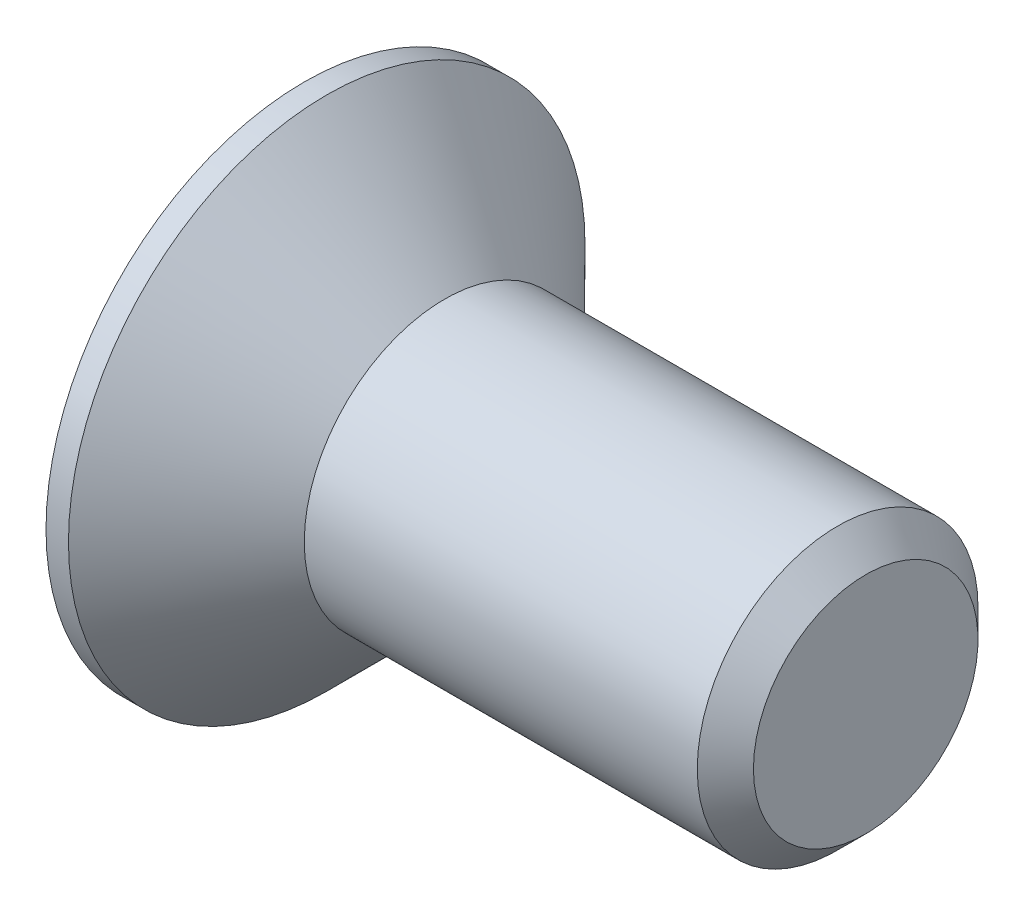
ISO-10303-21;
HEADER;
FILE_DESCRIPTION(('STEP AP214'),'2;1');
FILE_NAME('part.step','',(''),(''),'','','');
FILE_SCHEMA(('AUTOMOTIVE_DESIGN { 1 0 10303 214 1 1 1 1 }'));
ENDSEC;
DATA;
#1=APPLICATION_CONTEXT('core data for automotive mechanical design processes');
#2=APPLICATION_PROTOCOL_DEFINITION('international standard','automotive_design',2000,#1);
#3=PRODUCT_CONTEXT('',#1,'mechanical');
#4=PRODUCT('Part','Part','',(#3));
#5=PRODUCT_RELATED_PRODUCT_CATEGORY('part','',(#4));
#6=PRODUCT_DEFINITION_FORMATION('','',#4);
#7=PRODUCT_DEFINITION_CONTEXT('part definition',#1,'design');
#8=PRODUCT_DEFINITION('design','',#6,#7);
#9=PRODUCT_DEFINITION_SHAPE('','',#8);
#10=(LENGTH_UNIT() NAMED_UNIT(*) SI_UNIT(.MILLI.,.METRE.));
#11=(NAMED_UNIT(*) PLANE_ANGLE_UNIT() SI_UNIT($,.RADIAN.));
#12=(NAMED_UNIT(*) SI_UNIT($,.STERADIAN.) SOLID_ANGLE_UNIT());
#13=UNCERTAINTY_MEASURE_WITH_UNIT(LENGTH_MEASURE(1.E-05),#10,'distance_accuracy_value','');
#14=(GEOMETRIC_REPRESENTATION_CONTEXT(3) GLOBAL_UNCERTAINTY_ASSIGNED_CONTEXT((#13)) GLOBAL_UNIT_ASSIGNED_CONTEXT((#10,
#11,#12)) REPRESENTATION_CONTEXT('',''));
#15=CARTESIAN_POINT('',(0.,0.,0.));
#16=DIRECTION('',(0.,0.,1.));
#17=DIRECTION('',(1.,0.,0.));
#18=AXIS2_PLACEMENT_3D('',#15,#16,#17);
#19=CARTESIAN_POINT('',(0.,0.,0.));
#20=DIRECTION('',(-1.,0.,0.));
#21=DIRECTION('',(0.,0.,1.));
#22=AXIS2_PLACEMENT_3D('',#19,#20,#21);
#23=CONICAL_SURFACE('',#22,2.5,0.78539816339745);
#24=CARTESIAN_POINT('',(-2.09999999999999,0.,0.));
#25=DIRECTION('',(-1.,0.,0.));
#26=DIRECTION('',(0.,0.,1.));
#27=AXIS2_PLACEMENT_3D('',#24,#25,#26);
#28=CIRCLE('',#27,4.6);
#29=CARTESIAN_POINT('',(-2.09999999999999,0.,4.6));
#30=VERTEX_POINT('',#29);
#31=EDGE_CURVE('E189',#30,#30,#28,.T.);
#32=ORIENTED_EDGE('',*,*,#31,.F.);
#33=EDGE_LOOP('',(#32));
#34=FACE_BOUND('',#33,.T.);
#35=CARTESIAN_POINT('',(0.,0.,0.));
#36=DIRECTION('',(-1.,0.,0.));
#37=DIRECTION('',(0.,0.,1.));
#38=AXIS2_PLACEMENT_3D('',#35,#36,#37);
#39=CIRCLE('',#38,2.5);
#40=CARTESIAN_POINT('',(0.,0.,2.5));
#41=VERTEX_POINT('',#40);
#42=EDGE_CURVE('E212',#41,#41,#39,.T.);
#43=ORIENTED_EDGE('',*,*,#42,.T.);
#44=EDGE_LOOP('',(#43));
#45=FACE_BOUND('',#44,.T.);
#46=ADVANCED_FACE('F33',(#34,#45),#23,.T.);
#47=CARTESIAN_POINT('',(-2.5,0.,0.));
#48=DIRECTION('',(-1.,0.,0.));
#49=DIRECTION('',(0.,0.,1.));
#50=AXIS2_PLACEMENT_3D('',#47,#48,#49);
#51=CYLINDRICAL_SURFACE('',#50,2.5);
#52=CARTESIAN_POINT('',(6.99999999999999,0.,0.));
#53=DIRECTION('',(-1.,0.,0.));
#54=DIRECTION('',(0.,0.,1.));
#55=AXIS2_PLACEMENT_3D('',#52,#53,#54);
#56=CIRCLE('',#55,2.5);
#57=CARTESIAN_POINT('',(6.99999999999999,0.,2.5));
#58=VERTEX_POINT('',#57);
#59=EDGE_CURVE('E41',#58,#58,#56,.T.);
#60=ORIENTED_EDGE('',*,*,#59,.T.);
#61=EDGE_LOOP('',(#60));
#62=FACE_BOUND('',#61,.T.);
#63=ORIENTED_EDGE('',*,*,#42,.F.);
#64=EDGE_LOOP('',(#63));
#65=FACE_BOUND('',#64,.T.);
#66=ADVANCED_FACE('F217',(#62,#65),#51,.T.);
#67=CARTESIAN_POINT('',(7.5,0.,0.));
#68=DIRECTION('',(-1.,0.,0.));
#69=DIRECTION('',(0.,0.,1.));
#70=AXIS2_PLACEMENT_3D('',#67,#68,#69);
#71=PLANE('',#70);
#72=CARTESIAN_POINT('',(7.5,0.,0.));
#73=DIRECTION('',(-1.,0.,0.));
#74=DIRECTION('',(0.,0.,1.));
#75=AXIS2_PLACEMENT_3D('',#72,#73,#74);
#76=CIRCLE('',#75,1.99999999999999);
#77=CARTESIAN_POINT('',(7.5,0.,1.99999999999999));
#78=VERTEX_POINT('',#77);
#79=EDGE_CURVE('E11',#78,#78,#76,.F.);
#80=ORIENTED_EDGE('',*,*,#79,.T.);
#81=EDGE_LOOP('',(#80));
#82=FACE_BOUND('',#81,.T.);
#83=ADVANCED_FACE('F239',(#82),#71,.F.);
#84=CARTESIAN_POINT('',(-2.5,4.6,0.));
#85=DIRECTION('',(1.,0.,0.));
#86=DIRECTION('',(0.,0.,-1.));
#87=AXIS2_PLACEMENT_3D('',#84,#85,#86);
#88=PLANE('',#87);
#89=DIRECTION('',(0.,0.,-1.));
#90=VECTOR('',#89,1.);
#91=CARTESIAN_POINT('',(-2.5,0.575,-2.3));
#92=LINE('',#91,#90);
#93=CARTESIAN_POINT('',(-2.5,0.575,-0.575));
#94=VERTEX_POINT('',#93);
#95=CARTESIAN_POINT('',(-2.5,0.575,-2.3));
#96=VERTEX_POINT('',#95);
#97=EDGE_CURVE('E158',#94,#96,#92,.T.);
#98=ORIENTED_EDGE('',*,*,#97,.F.);
#99=DIRECTION('',(0.,-1.,0.));
#100=VECTOR('',#99,1.);
#101=CARTESIAN_POINT('',(-2.5,0.575,-0.575));
#102=LINE('',#101,#100);
#103=CARTESIAN_POINT('',(-2.5,2.3,-0.575));
#104=VERTEX_POINT('',#103);
#105=EDGE_CURVE('E48',#104,#94,#102,.T.);
#106=ORIENTED_EDGE('',*,*,#105,.F.);
#107=DIRECTION('',(0.,0.,-1.));
#108=VECTOR('',#107,1.);
#109=CARTESIAN_POINT('',(-2.5,2.3,-0.575));
#110=LINE('',#109,#108);
#111=CARTESIAN_POINT('',(-2.5,2.3,0.575));
#112=VERTEX_POINT('',#111);
#113=EDGE_CURVE('E185',#112,#104,#110,.T.);
#114=ORIENTED_EDGE('',*,*,#113,.F.);
#115=DIRECTION('',(0.,1.,0.));
#116=VECTOR('',#115,1.);
#117=CARTESIAN_POINT('',(-2.5,2.3,0.575));
#118=LINE('',#117,#116);
#119=CARTESIAN_POINT('',(-2.5,0.575,0.575));
#120=VERTEX_POINT('',#119);
#121=EDGE_CURVE('E183',#120,#112,#118,.T.);
#122=ORIENTED_EDGE('',*,*,#121,.F.);
#123=DIRECTION('',(0.,0.,-1.));
#124=VECTOR('',#123,1.);
#125=CARTESIAN_POINT('',(-2.5,0.575,0.575));
#126=LINE('',#125,#124);
#127=CARTESIAN_POINT('',(-2.5,0.575,2.3));
#128=VERTEX_POINT('',#127);
#129=EDGE_CURVE('E132',#128,#120,#126,.T.);
#130=ORIENTED_EDGE('',*,*,#129,.F.);
#131=DIRECTION('',(0.,1.,0.));
#132=VECTOR('',#131,1.);
#133=CARTESIAN_POINT('',(-2.5,0.575,2.3));
#134=LINE('',#133,#132);
#135=CARTESIAN_POINT('',(-2.5,-0.575,2.3));
#136=VERTEX_POINT('',#135);
#137=EDGE_CURVE('E179',#136,#128,#134,.T.);
#138=ORIENTED_EDGE('',*,*,#137,.F.);
#139=DIRECTION('',(0.,0.,1.));
#140=VECTOR('',#139,1.);
#141=CARTESIAN_POINT('',(-2.5,-0.575,2.3));
#142=LINE('',#141,#140);
#143=CARTESIAN_POINT('',(-2.5,-0.575,0.575));
#144=VERTEX_POINT('',#143);
#145=EDGE_CURVE('E176',#144,#136,#142,.T.);
#146=ORIENTED_EDGE('',*,*,#145,.F.);
#147=DIRECTION('',(0.,1.,0.));
#148=VECTOR('',#147,1.);
#149=CARTESIAN_POINT('',(-2.5,-0.575,0.575));
#150=LINE('',#149,#148);
#151=CARTESIAN_POINT('',(-2.5,-2.3,0.575));
#152=VERTEX_POINT('',#151);
#153=EDGE_CURVE('E173',#152,#144,#150,.T.);
#154=ORIENTED_EDGE('',*,*,#153,.F.);
#155=DIRECTION('',(0.,0.,1.));
#156=VECTOR('',#155,1.);
#157=CARTESIAN_POINT('',(-2.5,-2.3,0.575));
#158=LINE('',#157,#156);
#159=CARTESIAN_POINT('',(-2.5,-2.3,-0.575));
#160=VERTEX_POINT('',#159);
#161=EDGE_CURVE('E170',#160,#152,#158,.T.);
#162=ORIENTED_EDGE('',*,*,#161,.F.);
#163=DIRECTION('',(0.,-1.,0.));
#164=VECTOR('',#163,1.);
#165=CARTESIAN_POINT('',(-2.5,-2.3,-0.575));
#166=LINE('',#165,#164);
#167=CARTESIAN_POINT('',(-2.5,-0.575,-0.575));
#168=VERTEX_POINT('',#167);
#169=EDGE_CURVE('E167',#168,#160,#166,.T.);
#170=ORIENTED_EDGE('',*,*,#169,.F.);
#171=DIRECTION('',(0.,0.,1.));
#172=VECTOR('',#171,1.);
#173=CARTESIAN_POINT('',(-2.5,-0.575,-0.575));
#174=LINE('',#173,#172);
#175=CARTESIAN_POINT('',(-2.5,-0.575,-2.3));
#176=VERTEX_POINT('',#175);
#177=EDGE_CURVE('E164',#176,#168,#174,.T.);
#178=ORIENTED_EDGE('',*,*,#177,.F.);
#179=DIRECTION('',(0.,-1.,0.));
#180=VECTOR('',#179,1.);
#181=CARTESIAN_POINT('',(-2.5,-0.575,-2.3));
#182=LINE('',#181,#180);
#183=EDGE_CURVE('E161',#96,#176,#182,.T.);
#184=ORIENTED_EDGE('',*,*,#183,.F.);
#185=EDGE_LOOP('',(#98,#106,#114,#122,#130,#138,#146,#154,#162,#170,#178,#184));
#186=FACE_BOUND('',#185,.T.);
#187=CARTESIAN_POINT('',(-2.5,0.,0.));
#188=DIRECTION('',(-1.,0.,0.));
#189=DIRECTION('',(0.,0.,1.));
#190=AXIS2_PLACEMENT_3D('',#187,#188,#189);
#191=CIRCLE('',#190,4.6);
#192=CARTESIAN_POINT('',(-2.5,0.,4.6));
#193=VERTEX_POINT('',#192);
#194=EDGE_CURVE('E209',#193,#193,#191,.T.);
#195=ORIENTED_EDGE('',*,*,#194,.T.);
#196=EDGE_LOOP('',(#195));
#197=FACE_BOUND('',#196,.T.);
#198=ADVANCED_FACE('F230',(#186,#197),#88,.F.);
#199=CARTESIAN_POINT('',(-2.5,0.,0.));
#200=DIRECTION('',(-1.,0.,0.));
#201=DIRECTION('',(0.,0.,1.));
#202=AXIS2_PLACEMENT_3D('',#199,#200,#201);
#203=CYLINDRICAL_SURFACE('',#202,4.6);
#204=ORIENTED_EDGE('',*,*,#194,.F.);
#205=EDGE_LOOP('',(#204));
#206=FACE_BOUND('',#205,.T.);
#207=ORIENTED_EDGE('',*,*,#31,.T.);
#208=EDGE_LOOP('',(#207));
#209=FACE_BOUND('',#208,.T.);
#210=ADVANCED_FACE('F222',(#206,#209),#203,.T.);
#211=CARTESIAN_POINT('',(6.99999999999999,0.,0.));
#212=DIRECTION('',(-1.,0.,0.));
#213=DIRECTION('',(0.,0.,1.));
#214=AXIS2_PLACEMENT_3D('',#211,#212,#213);
#215=CONICAL_SURFACE('',#214,2.5,0.785398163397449);
#216=ORIENTED_EDGE('',*,*,#79,.F.);
#217=EDGE_LOOP('',(#216));
#218=FACE_BOUND('',#217,.T.);
#219=ORIENTED_EDGE('',*,*,#59,.F.);
#220=EDGE_LOOP('',(#219));
#221=FACE_BOUND('',#220,.T.);
#222=ADVANCED_FACE('F35',(#218,#221),#215,.T.);
#223=CARTESIAN_POINT('',(-0.4,0.575,-0.575));
#224=DIRECTION('',(0.,0.,-1.));
#225=DIRECTION('',(-1.,0.,0.));
#226=AXIS2_PLACEMENT_3D('',#223,#224,#225);
#227=PLANE('',#226);
#228=ORIENTED_EDGE('',*,*,#105,.T.);
#229=DIRECTION('',(-1.,0.,0.));
#230=VECTOR('',#229,1.);
#231=CARTESIAN_POINT('',(-0.4,0.575,-0.575));
#232=LINE('',#231,#230);
#233=CARTESIAN_POINT('',(-0.4,0.575,-0.575));
#234=VERTEX_POINT('',#233);
#235=EDGE_CURVE('E96',#234,#94,#232,.T.);
#236=ORIENTED_EDGE('',*,*,#235,.F.);
#237=DIRECTION('',(0.,-1.,0.));
#238=VECTOR('',#237,1.);
#239=CARTESIAN_POINT('',(-0.4,0.575,-0.575));
#240=LINE('',#239,#238);
#241=CARTESIAN_POINT('',(-0.4,2.3,-0.575));
#242=VERTEX_POINT('',#241);
#243=EDGE_CURVE('E187',#242,#234,#240,.T.);
#244=ORIENTED_EDGE('',*,*,#243,.F.);
#245=DIRECTION('',(-1.,0.,0.));
#246=VECTOR('',#245,1.);
#247=CARTESIAN_POINT('',(-0.4,2.3,-0.575));
#248=LINE('',#247,#246);
#249=EDGE_CURVE('E56',#242,#104,#248,.T.);
#250=ORIENTED_EDGE('',*,*,#249,.T.);
#251=EDGE_LOOP('',(#228,#236,#244,#250));
#252=FACE_BOUND('',#251,.T.);
#253=ADVANCED_FACE('F221',(#252),#227,.F.);
#254=CARTESIAN_POINT('',(-0.4,2.3,-0.575));
#255=DIRECTION('',(0.,1.,0.));
#256=DIRECTION('',(-1.,0.,0.));
#257=AXIS2_PLACEMENT_3D('',#254,#255,#256);
#258=PLANE('',#257);
#259=ORIENTED_EDGE('',*,*,#113,.T.);
#260=ORIENTED_EDGE('',*,*,#249,.F.);
#261=DIRECTION('',(0.,0.,-1.));
#262=VECTOR('',#261,1.);
#263=CARTESIAN_POINT('',(-0.4,2.3,-0.575));
#264=LINE('',#263,#262);
#265=CARTESIAN_POINT('',(-0.4,2.3,0.575));
#266=VERTEX_POINT('',#265);
#267=EDGE_CURVE('E144',#266,#242,#264,.T.);
#268=ORIENTED_EDGE('',*,*,#267,.F.);
#269=DIRECTION('',(-1.,0.,0.));
#270=VECTOR('',#269,1.);
#271=CARTESIAN_POINT('',(-0.4,2.3,0.575));
#272=LINE('',#271,#270);
#273=EDGE_CURVE('E136',#266,#112,#272,.T.);
#274=ORIENTED_EDGE('',*,*,#273,.T.);
#275=EDGE_LOOP('',(#259,#260,#268,#274));
#276=FACE_BOUND('',#275,.T.);
#277=ADVANCED_FACE('F228',(#276),#258,.F.);
#278=CARTESIAN_POINT('',(-0.4,2.3,0.575));
#279=DIRECTION('',(0.,0.,1.));
#280=DIRECTION('',(1.,0.,0.));
#281=AXIS2_PLACEMENT_3D('',#278,#279,#280);
#282=PLANE('',#281);
#283=ORIENTED_EDGE('',*,*,#121,.T.);
#284=ORIENTED_EDGE('',*,*,#273,.F.);
#285=DIRECTION('',(0.,1.,0.));
#286=VECTOR('',#285,1.);
#287=CARTESIAN_POINT('',(-0.4,2.3,0.575));
#288=LINE('',#287,#286);
#289=CARTESIAN_POINT('',(-0.4,0.575,0.575));
#290=VERTEX_POINT('',#289);
#291=EDGE_CURVE('E140',#290,#266,#288,.T.);
#292=ORIENTED_EDGE('',*,*,#291,.F.);
#293=DIRECTION('',(-1.,0.,0.));
#294=VECTOR('',#293,1.);
#295=CARTESIAN_POINT('',(-0.4,0.575,0.575));
#296=LINE('',#295,#294);
#297=EDGE_CURVE('E125',#290,#120,#296,.T.);
#298=ORIENTED_EDGE('',*,*,#297,.T.);
#299=EDGE_LOOP('',(#283,#284,#292,#298));
#300=FACE_BOUND('',#299,.T.);
#301=ADVANCED_FACE('F141',(#300),#282,.F.);
#302=CARTESIAN_POINT('',(-0.4,0.575,0.575));
#303=DIRECTION('',(0.,1.,0.));
#304=DIRECTION('',(-1.,0.,0.));
#305=AXIS2_PLACEMENT_3D('',#302,#303,#304);
#306=PLANE('',#305);
#307=ORIENTED_EDGE('',*,*,#129,.T.);
#308=ORIENTED_EDGE('',*,*,#297,.F.);
#309=DIRECTION('',(0.,0.,-1.));
#310=VECTOR('',#309,1.);
#311=CARTESIAN_POINT('',(-0.4,0.575,0.575));
#312=LINE('',#311,#310);
#313=CARTESIAN_POINT('',(-0.4,0.575,2.3));
#314=VERTEX_POINT('',#313);
#315=EDGE_CURVE('E129',#314,#290,#312,.T.);
#316=ORIENTED_EDGE('',*,*,#315,.F.);
#317=DIRECTION('',(-1.,0.,0.));
#318=VECTOR('',#317,1.);
#319=CARTESIAN_POINT('',(-0.4,0.575,2.3));
#320=LINE('',#319,#318);
#321=EDGE_CURVE('E137',#314,#128,#320,.T.);
#322=ORIENTED_EDGE('',*,*,#321,.T.);
#323=EDGE_LOOP('',(#307,#308,#316,#322));
#324=FACE_BOUND('',#323,.T.);
#325=ADVANCED_FACE('F127',(#324),#306,.F.);
#326=CARTESIAN_POINT('',(-0.4,0.575,2.3));
#327=DIRECTION('',(0.,0.,1.));
#328=DIRECTION('',(1.,0.,0.));
#329=AXIS2_PLACEMENT_3D('',#326,#327,#328);
#330=PLANE('',#329);
#331=ORIENTED_EDGE('',*,*,#137,.T.);
#332=ORIENTED_EDGE('',*,*,#321,.F.);
#333=DIRECTION('',(0.,1.,0.));
#334=VECTOR('',#333,1.);
#335=CARTESIAN_POINT('',(-0.4,0.575,2.3));
#336=LINE('',#335,#334);
#337=CARTESIAN_POINT('',(-0.4,-0.575,2.3));
#338=VERTEX_POINT('',#337);
#339=EDGE_CURVE('E150',#338,#314,#336,.T.);
#340=ORIENTED_EDGE('',*,*,#339,.F.);
#341=DIRECTION('',(-1.,0.,0.));
#342=VECTOR('',#341,1.);
#343=CARTESIAN_POINT('',(-0.4,-0.575,2.3));
#344=LINE('',#343,#342);
#345=EDGE_CURVE('E192',#338,#136,#344,.T.);
#346=ORIENTED_EDGE('',*,*,#345,.T.);
#347=EDGE_LOOP('',(#331,#332,#340,#346));
#348=FACE_BOUND('',#347,.T.);
#349=ADVANCED_FACE('F277',(#348),#330,.F.);
#350=CARTESIAN_POINT('',(-0.4,-0.575,2.3));
#351=DIRECTION('',(0.,-1.,0.));
#352=DIRECTION('',(1.,0.,0.));
#353=AXIS2_PLACEMENT_3D('',#350,#351,#352);
#354=PLANE('',#353);
#355=ORIENTED_EDGE('',*,*,#145,.T.);
#356=ORIENTED_EDGE('',*,*,#345,.F.);
#357=DIRECTION('',(0.,0.,1.));
#358=VECTOR('',#357,1.);
#359=CARTESIAN_POINT('',(-0.4,-0.575,2.3));
#360=LINE('',#359,#358);
#361=CARTESIAN_POINT('',(-0.4,-0.575,0.575));
#362=VERTEX_POINT('',#361);
#363=EDGE_CURVE('E152',#362,#338,#360,.T.);
#364=ORIENTED_EDGE('',*,*,#363,.F.);
#365=DIRECTION('',(-1.,0.,0.));
#366=VECTOR('',#365,1.);
#367=CARTESIAN_POINT('',(-0.4,-0.575,0.575));
#368=LINE('',#367,#366);
#369=EDGE_CURVE('E194',#362,#144,#368,.T.);
#370=ORIENTED_EDGE('',*,*,#369,.T.);
#371=EDGE_LOOP('',(#355,#356,#364,#370));
#372=FACE_BOUND('',#371,.T.);
#373=ADVANCED_FACE('F273',(#372),#354,.F.);
#374=CARTESIAN_POINT('',(-0.4,-0.575,0.575));
#375=DIRECTION('',(0.,0.,1.));
#376=DIRECTION('',(1.,0.,0.));
#377=AXIS2_PLACEMENT_3D('',#374,#375,#376);
#378=PLANE('',#377);
#379=ORIENTED_EDGE('',*,*,#153,.T.);
#380=ORIENTED_EDGE('',*,*,#369,.F.);
#381=DIRECTION('',(0.,1.,0.));
#382=VECTOR('',#381,1.);
#383=CARTESIAN_POINT('',(-0.4,-0.575,0.575));
#384=LINE('',#383,#382);
#385=CARTESIAN_POINT('',(-0.4,-2.3,0.575));
#386=VERTEX_POINT('',#385);
#387=EDGE_CURVE('E422',#386,#362,#384,.T.);
#388=ORIENTED_EDGE('',*,*,#387,.F.);
#389=DIRECTION('',(-1.,0.,0.));
#390=VECTOR('',#389,1.);
#391=CARTESIAN_POINT('',(-0.4,-2.3,0.575));
#392=LINE('',#391,#390);
#393=EDGE_CURVE('E196',#386,#152,#392,.T.);
#394=ORIENTED_EDGE('',*,*,#393,.T.);
#395=EDGE_LOOP('',(#379,#380,#388,#394));
#396=FACE_BOUND('',#395,.T.);
#397=ADVANCED_FACE('F269',(#396),#378,.F.);
#398=CARTESIAN_POINT('',(-0.4,-2.3,0.575));
#399=DIRECTION('',(0.,-1.,0.));
#400=DIRECTION('',(1.,0.,0.));
#401=AXIS2_PLACEMENT_3D('',#398,#399,#400);
#402=PLANE('',#401);
#403=ORIENTED_EDGE('',*,*,#161,.T.);
#404=ORIENTED_EDGE('',*,*,#393,.F.);
#405=DIRECTION('',(0.,0.,1.));
#406=VECTOR('',#405,1.);
#407=CARTESIAN_POINT('',(-0.4,-2.3,0.575));
#408=LINE('',#407,#406);
#409=CARTESIAN_POINT('',(-0.4,-2.3,-0.575));
#410=VERTEX_POINT('',#409);
#411=EDGE_CURVE('E419',#410,#386,#408,.T.);
#412=ORIENTED_EDGE('',*,*,#411,.F.);
#413=DIRECTION('',(-1.,0.,0.));
#414=VECTOR('',#413,1.);
#415=CARTESIAN_POINT('',(-0.4,-2.3,-0.575));
#416=LINE('',#415,#414);
#417=EDGE_CURVE('E198',#410,#160,#416,.T.);
#418=ORIENTED_EDGE('',*,*,#417,.T.);
#419=EDGE_LOOP('',(#403,#404,#412,#418));
#420=FACE_BOUND('',#419,.T.);
#421=ADVANCED_FACE('F265',(#420),#402,.F.);
#422=CARTESIAN_POINT('',(-0.4,-2.3,-0.575));
#423=DIRECTION('',(0.,0.,-1.));
#424=DIRECTION('',(-1.,0.,0.));
#425=AXIS2_PLACEMENT_3D('',#422,#423,#424);
#426=PLANE('',#425);
#427=ORIENTED_EDGE('',*,*,#169,.T.);
#428=ORIENTED_EDGE('',*,*,#417,.F.);
#429=DIRECTION('',(0.,-1.,0.));
#430=VECTOR('',#429,1.);
#431=CARTESIAN_POINT('',(-0.4,-2.3,-0.575));
#432=LINE('',#431,#430);
#433=CARTESIAN_POINT('',(-0.4,-0.575,-0.575));
#434=VERTEX_POINT('',#433);
#435=EDGE_CURVE('E416',#434,#410,#432,.T.);
#436=ORIENTED_EDGE('',*,*,#435,.F.);
#437=DIRECTION('',(-1.,0.,0.));
#438=VECTOR('',#437,1.);
#439=CARTESIAN_POINT('',(-0.4,-0.575,-0.575));
#440=LINE('',#439,#438);
#441=EDGE_CURVE('E200',#434,#168,#440,.T.);
#442=ORIENTED_EDGE('',*,*,#441,.T.);
#443=EDGE_LOOP('',(#427,#428,#436,#442));
#444=FACE_BOUND('',#443,.T.);
#445=ADVANCED_FACE('F261',(#444),#426,.F.);
#446=CARTESIAN_POINT('',(-0.4,-0.575,-0.575));
#447=DIRECTION('',(0.,-1.,0.));
#448=DIRECTION('',(1.,0.,0.));
#449=AXIS2_PLACEMENT_3D('',#446,#447,#448);
#450=PLANE('',#449);
#451=ORIENTED_EDGE('',*,*,#177,.T.);
#452=ORIENTED_EDGE('',*,*,#441,.F.);
#453=DIRECTION('',(0.,0.,1.));
#454=VECTOR('',#453,1.);
#455=CARTESIAN_POINT('',(-0.4,-0.575,-0.575));
#456=LINE('',#455,#454);
#457=CARTESIAN_POINT('',(-0.4,-0.575,-2.3));
#458=VERTEX_POINT('',#457);
#459=EDGE_CURVE('E413',#458,#434,#456,.T.);
#460=ORIENTED_EDGE('',*,*,#459,.F.);
#461=DIRECTION('',(-1.,0.,0.));
#462=VECTOR('',#461,1.);
#463=CARTESIAN_POINT('',(-0.4,-0.575,-2.3));
#464=LINE('',#463,#462);
#465=EDGE_CURVE('E202',#458,#176,#464,.T.);
#466=ORIENTED_EDGE('',*,*,#465,.T.);
#467=EDGE_LOOP('',(#451,#452,#460,#466));
#468=FACE_BOUND('',#467,.T.);
#469=ADVANCED_FACE('F257',(#468),#450,.F.);
#470=CARTESIAN_POINT('',(-0.4,-0.575,-2.3));
#471=DIRECTION('',(0.,0.,-1.));
#472=DIRECTION('',(-1.,0.,0.));
#473=AXIS2_PLACEMENT_3D('',#470,#471,#472);
#474=PLANE('',#473);
#475=ORIENTED_EDGE('',*,*,#183,.T.);
#476=ORIENTED_EDGE('',*,*,#465,.F.);
#477=DIRECTION('',(0.,-1.,0.));
#478=VECTOR('',#477,1.);
#479=CARTESIAN_POINT('',(-0.4,-0.575,-2.3));
#480=LINE('',#479,#478);
#481=CARTESIAN_POINT('',(-0.4,0.575,-2.3));
#482=VERTEX_POINT('',#481);
#483=EDGE_CURVE('E408',#482,#458,#480,.T.);
#484=ORIENTED_EDGE('',*,*,#483,.F.);
#485=DIRECTION('',(-1.,0.,0.));
#486=VECTOR('',#485,1.);
#487=CARTESIAN_POINT('',(-0.4,0.575,-2.3));
#488=LINE('',#487,#486);
#489=EDGE_CURVE('E204',#482,#96,#488,.T.);
#490=ORIENTED_EDGE('',*,*,#489,.T.);
#491=EDGE_LOOP('',(#475,#476,#484,#490));
#492=FACE_BOUND('',#491,.T.);
#493=ADVANCED_FACE('F253',(#492),#474,.F.);
#494=CARTESIAN_POINT('',(-0.4,0.575,-2.3));
#495=DIRECTION('',(0.,1.,0.));
#496=DIRECTION('',(-1.,0.,0.));
#497=AXIS2_PLACEMENT_3D('',#494,#495,#496);
#498=PLANE('',#497);
#499=ORIENTED_EDGE('',*,*,#97,.T.);
#500=ORIENTED_EDGE('',*,*,#489,.F.);
#501=DIRECTION('',(0.,0.,-1.));
#502=VECTOR('',#501,1.);
#503=CARTESIAN_POINT('',(-0.4,0.575,-2.3));
#504=LINE('',#503,#502);
#505=EDGE_CURVE('E406',#234,#482,#504,.T.);
#506=ORIENTED_EDGE('',*,*,#505,.F.);
#507=ORIENTED_EDGE('',*,*,#235,.T.);
#508=EDGE_LOOP('',(#499,#500,#506,#507));
#509=FACE_BOUND('',#508,.T.);
#510=ADVANCED_FACE('F250',(#509),#498,.F.);
#511=CARTESIAN_POINT('',(-0.4,0.,0.));
#512=DIRECTION('',(1.,0.,0.));
#513=DIRECTION('',(0.,0.,-1.));
#514=AXIS2_PLACEMENT_3D('',#511,#512,#513);
#515=PLANE('',#514);
#516=ORIENTED_EDGE('',*,*,#243,.T.);
#517=ORIENTED_EDGE('',*,*,#505,.T.);
#518=ORIENTED_EDGE('',*,*,#483,.T.);
#519=ORIENTED_EDGE('',*,*,#459,.T.);
#520=ORIENTED_EDGE('',*,*,#435,.T.);
#521=ORIENTED_EDGE('',*,*,#411,.T.);
#522=ORIENTED_EDGE('',*,*,#387,.T.);
#523=ORIENTED_EDGE('',*,*,#363,.T.);
#524=ORIENTED_EDGE('',*,*,#339,.T.);
#525=ORIENTED_EDGE('',*,*,#315,.T.);
#526=ORIENTED_EDGE('',*,*,#291,.T.);
#527=ORIENTED_EDGE('',*,*,#267,.T.);
#528=EDGE_LOOP('',(#516,#517,#518,#519,#520,#521,#522,#523,#524,#525,#526,#527));
#529=FACE_BOUND('',#528,.T.);
#530=ADVANCED_FACE('F147',(#529),#515,.F.);
#531=CLOSED_SHELL('',(#46,#66,#83,#198,#210,#222,#253,#277,#301,#325,#349,#373,#397,#421,#445,
#469,#493,#510,#530));
#532=MANIFOLD_SOLID_BREP('B2',#531);
#533=ADVANCED_BREP_SHAPE_REPRESENTATION('',(#18,#532),#14);
#534=SHAPE_DEFINITION_REPRESENTATION(#9,#533);
ENDSEC;
END-ISO-10303-21;
